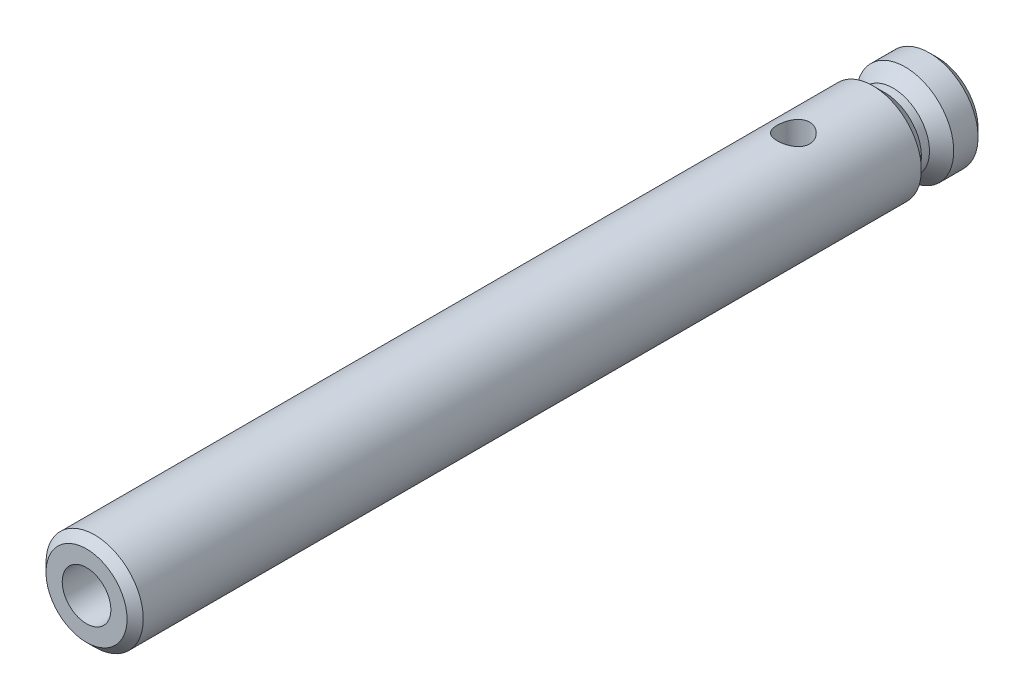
from build123d import *

# Parameters (mm, degrees)
ENL_V_MAT_EXTRU_1_DEPTH      = 1
ENL_V_MAT_EXTRU_1_DEPTH_BACK = 211.442658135
ESQUISSE2_R                  = 2
CHANFREIN1_SIZE              = 1


with BuildPart() as part:
    # Esquisse1 → Base-R_volution (revolve)
    with BuildSketch(Plane.XZ.offset(185.427795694), mode=Mode.PRIVATE) as base_r_volution_sk:
        Polygon((3, 72.20958318), (0, 72.20958318), (0, -2.79041682), (3, -2.79041682), (3, -17.79041682), (6, -17.79041682), (6, -13.79041682), (4.5, -12.29041682), (4.5, -11.29041682), (6, -9.79041682), (6, 87.20958318), (3, 87.20958318), align=None)
    revolve(base_r_volution_sk.sketch.rotate(Axis((0, -185.427795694, 87.20958318), (0, 0, -1)), 180), axis=Axis((0, -185.427795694, 87.20958318), (0, 0, -1)))

    # Esquisse2 → Enl_v. mat.-Extru.1 (cut, two sides: drawn at the far end of the back side and taken through both)
    with BuildSketch(Plane(origin=(0, 0, 0), x_dir=(1, 0, 0), z_dir=(0, 1, 0)).offset(-ENL_V_MAT_EXTRU_1_DEPTH_BACK)):
        with Locations(Location((0, 0, 0), (0, 0, 270))):
            Circle(ESQUISSE2_R)
    extrude(amount=ENL_V_MAT_EXTRU_1_DEPTH + ENL_V_MAT_EXTRU_1_DEPTH_BACK, mode=Mode.SUBTRACT)

    # Chanfrein1
    chanfrein1_edges = [part.edges().sort_by_distance(p)[0] for p in [
        (6, -185.427795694, 87.20958318),
        (6, -185.427795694, -17.79041682),
    ]]
    chamfer(chanfrein1_edges, length=CHANFREIN1_SIZE)


solid = part.part
